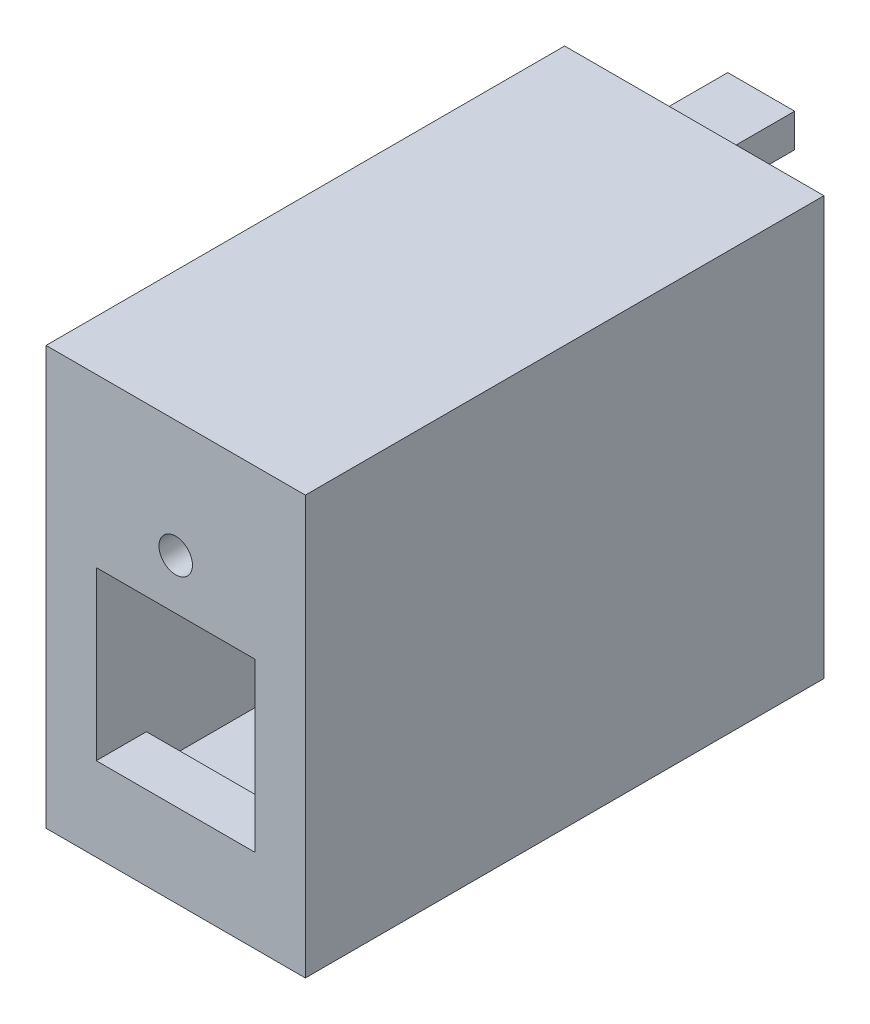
ISO-10303-21;
HEADER;
FILE_DESCRIPTION(('STEP AP214'),'2;1');
FILE_NAME('part.step','',(''),(''),'','','');
FILE_SCHEMA(('AUTOMOTIVE_DESIGN { 1 0 10303 214 1 1 1 1 }'));
ENDSEC;
DATA;
#1=APPLICATION_CONTEXT('core data for automotive mechanical design processes');
#2=APPLICATION_PROTOCOL_DEFINITION('international standard','automotive_design',2000,#1);
#3=PRODUCT_CONTEXT('',#1,'mechanical');
#4=PRODUCT('Part','Part','',(#3));
#5=PRODUCT_RELATED_PRODUCT_CATEGORY('part','',(#4));
#6=PRODUCT_DEFINITION_FORMATION('','',#4);
#7=PRODUCT_DEFINITION_CONTEXT('part definition',#1,'design');
#8=PRODUCT_DEFINITION('design','',#6,#7);
#9=PRODUCT_DEFINITION_SHAPE('','',#8);
#10=(LENGTH_UNIT() NAMED_UNIT(*) SI_UNIT(.MILLI.,.METRE.));
#11=(NAMED_UNIT(*) PLANE_ANGLE_UNIT() SI_UNIT($,.RADIAN.));
#12=(NAMED_UNIT(*) SI_UNIT($,.STERADIAN.) SOLID_ANGLE_UNIT());
#13=UNCERTAINTY_MEASURE_WITH_UNIT(LENGTH_MEASURE(1.E-05),#10,'distance_accuracy_value','');
#14=(GEOMETRIC_REPRESENTATION_CONTEXT(3) GLOBAL_UNCERTAINTY_ASSIGNED_CONTEXT((#13)) GLOBAL_UNIT_ASSIGNED_CONTEXT((#10,
#11,#12)) REPRESENTATION_CONTEXT('',''));
#15=CARTESIAN_POINT('',(0.,0.,0.));
#16=DIRECTION('',(0.,0.,1.));
#17=DIRECTION('',(1.,0.,0.));
#18=AXIS2_PLACEMENT_3D('',#15,#16,#17);
#19=CARTESIAN_POINT('',(0.,0.,0.));
#20=DIRECTION('',(0.,0.,1.));
#21=DIRECTION('',(1.,0.,0.));
#22=AXIS2_PLACEMENT_3D('',#19,#20,#21);
#23=PLANE('',#22);
#24=DIRECTION('',(1.,0.,0.));
#25=VECTOR('',#24,1.);
#26=CARTESIAN_POINT('',(96.75,-12.,0.));
#27=LINE('',#26,#25);
#28=CARTESIAN_POINT('',(92.75,-12.,0.));
#29=VERTEX_POINT('',#28);
#30=CARTESIAN_POINT('',(96.75,-12.,0.));
#31=VERTEX_POINT('',#30);
#32=EDGE_CURVE('E206',#29,#31,#27,.T.);
#33=ORIENTED_EDGE('',*,*,#32,.T.);
#34=DIRECTION('',(0.,1.,0.));
#35=VECTOR('',#34,1.);
#36=CARTESIAN_POINT('',(96.75,-12.,0.));
#37=LINE('',#36,#35);
#38=CARTESIAN_POINT('',(96.75,-10.,0.));
#39=VERTEX_POINT('',#38);
#40=EDGE_CURVE('E180',#31,#39,#37,.T.);
#41=ORIENTED_EDGE('',*,*,#40,.T.);
#42=DIRECTION('',(-1.,0.,0.));
#43=VECTOR('',#42,1.);
#44=CARTESIAN_POINT('',(96.75,-10.,0.));
#45=LINE('',#44,#43);
#46=CARTESIAN_POINT('',(92.75,-10.,0.));
#47=VERTEX_POINT('',#46);
#48=EDGE_CURVE('E196',#39,#47,#45,.T.);
#49=ORIENTED_EDGE('',*,*,#48,.T.);
#50=DIRECTION('',(0.,-1.,0.));
#51=VECTOR('',#50,1.);
#52=CARTESIAN_POINT('',(92.75,-12.,0.));
#53=LINE('',#52,#51);
#54=EDGE_CURVE('E52',#47,#29,#53,.T.);
#55=ORIENTED_EDGE('',*,*,#54,.T.);
#56=EDGE_LOOP('',(#33,#41,#49,#55));
#57=FACE_BOUND('',#56,.T.);
#58=DIRECTION('',(0.,1.,0.));
#59=VECTOR('',#58,1.);
#60=CARTESIAN_POINT('',(102.5,12.5,0.));
#61=LINE('',#60,#59);
#62=CARTESIAN_POINT('',(102.5,-12.5,0.));
#63=VERTEX_POINT('',#62);
#64=CARTESIAN_POINT('',(102.5,12.5,0.));
#65=VERTEX_POINT('',#64);
#66=EDGE_CURVE('E340',#63,#65,#61,.T.);
#67=ORIENTED_EDGE('',*,*,#66,.F.);
#68=DIRECTION('',(1.,0.,0.));
#69=VECTOR('',#68,1.);
#70=CARTESIAN_POINT('',(87.,-12.5,0.));
#71=LINE('',#70,#69);
#72=CARTESIAN_POINT('',(87.,-12.5,0.));
#73=VERTEX_POINT('',#72);
#74=EDGE_CURVE('E327',#73,#63,#71,.T.);
#75=ORIENTED_EDGE('',*,*,#74,.F.);
#76=DIRECTION('',(0.,-1.,0.));
#77=VECTOR('',#76,1.);
#78=CARTESIAN_POINT('',(87.,12.5,0.));
#79=LINE('',#78,#77);
#80=CARTESIAN_POINT('',(87.,12.5,0.));
#81=VERTEX_POINT('',#80);
#82=EDGE_CURVE('E332',#81,#73,#79,.T.);
#83=ORIENTED_EDGE('',*,*,#82,.F.);
#84=DIRECTION('',(-1.,0.,0.));
#85=VECTOR('',#84,1.);
#86=CARTESIAN_POINT('',(87.,12.5,0.));
#87=LINE('',#86,#85);
#88=EDGE_CURVE('E336',#65,#81,#87,.T.);
#89=ORIENTED_EDGE('',*,*,#88,.F.);
#90=EDGE_LOOP('',(#67,#75,#83,#89));
#91=FACE_BOUND('',#90,.T.);
#92=DIRECTION('',(1.,0.,0.));
#93=VECTOR('',#92,1.);
#94=CARTESIAN_POINT('',(87.,-9.49999999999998,0.));
#95=LINE('',#94,#93);
#96=CARTESIAN_POINT('',(90.,-9.49999999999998,0.));
#97=VERTEX_POINT('',#96);
#98=CARTESIAN_POINT('',(99.5,-9.49999999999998,0.));
#99=VERTEX_POINT('',#98);
#100=EDGE_CURVE('E311',#97,#99,#95,.T.);
#101=ORIENTED_EDGE('',*,*,#100,.T.);
#102=DIRECTION('',(0.,1.,0.));
#103=VECTOR('',#102,1.);
#104=CARTESIAN_POINT('',(99.5,12.5,0.));
#105=LINE('',#104,#103);
#106=CARTESIAN_POINT('',(99.5,9.50000000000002,0.));
#107=VERTEX_POINT('',#106);
#108=EDGE_CURVE('E316',#99,#107,#105,.T.);
#109=ORIENTED_EDGE('',*,*,#108,.T.);
#110=DIRECTION('',(-1.,0.,0.));
#111=VECTOR('',#110,1.);
#112=CARTESIAN_POINT('',(87.,9.50000000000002,0.));
#113=LINE('',#112,#111);
#114=CARTESIAN_POINT('',(90.,9.50000000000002,0.));
#115=VERTEX_POINT('',#114);
#116=EDGE_CURVE('E324',#107,#115,#113,.T.);
#117=ORIENTED_EDGE('',*,*,#116,.T.);
#118=DIRECTION('',(0.,-1.,0.));
#119=VECTOR('',#118,1.);
#120=CARTESIAN_POINT('',(90.,12.5,0.));
#121=LINE('',#120,#119);
#122=EDGE_CURVE('E312',#115,#97,#121,.T.);
#123=ORIENTED_EDGE('',*,*,#122,.T.);
#124=EDGE_LOOP('',(#101,#109,#117,#123));
#125=FACE_BOUND('',#124,.T.);
#126=DIRECTION('',(0.,-1.,0.));
#127=VECTOR('',#126,1.);
#128=CARTESIAN_POINT('',(96.75,12.,0.));
#129=LINE('',#128,#127);
#130=CARTESIAN_POINT('',(96.75,12.,0.));
#131=VERTEX_POINT('',#130);
#132=CARTESIAN_POINT('',(96.75,10.,0.));
#133=VERTEX_POINT('',#132);
#134=EDGE_CURVE('E185',#131,#133,#129,.T.);
#135=ORIENTED_EDGE('',*,*,#134,.F.);
#136=DIRECTION('',(1.,0.,0.));
#137=VECTOR('',#136,1.);
#138=CARTESIAN_POINT('',(96.75,12.,0.));
#139=LINE('',#138,#137);
#140=CARTESIAN_POINT('',(92.75,12.,0.));
#141=VERTEX_POINT('',#140);
#142=EDGE_CURVE('E219',#141,#131,#139,.T.);
#143=ORIENTED_EDGE('',*,*,#142,.F.);
#144=DIRECTION('',(0.,1.,0.));
#145=VECTOR('',#144,1.);
#146=CARTESIAN_POINT('',(92.75,12.,0.));
#147=LINE('',#146,#145);
#148=CARTESIAN_POINT('',(92.75,10.,0.));
#149=VERTEX_POINT('',#148);
#150=EDGE_CURVE('E229',#149,#141,#147,.T.);
#151=ORIENTED_EDGE('',*,*,#150,.F.);
#152=DIRECTION('',(-1.,0.,0.));
#153=VECTOR('',#152,1.);
#154=CARTESIAN_POINT('',(96.75,10.,0.));
#155=LINE('',#154,#153);
#156=EDGE_CURVE('E60',#133,#149,#155,.T.);
#157=ORIENTED_EDGE('',*,*,#156,.F.);
#158=EDGE_LOOP('',(#135,#143,#151,#157));
#159=FACE_BOUND('',#158,.T.);
#160=ADVANCED_FACE('F35',(#57,#91,#125,#159),#23,.F.);
#161=CARTESIAN_POINT('',(0.,0.,28.));
#162=DIRECTION('',(0.,0.,1.));
#163=DIRECTION('',(1.,0.,0.));
#164=AXIS2_PLACEMENT_3D('',#161,#162,#163);
#165=PLANE('',#164);
#166=DIRECTION('',(-1.,0.,0.));
#167=VECTOR('',#166,1.);
#168=CARTESIAN_POINT('',(90.,-7.49999999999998,28.));
#169=LINE('',#168,#167);
#170=CARTESIAN_POINT('',(99.5,-7.49999999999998,28.));
#171=VERTEX_POINT('',#170);
#172=CARTESIAN_POINT('',(90.,-7.49999999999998,28.));
#173=VERTEX_POINT('',#172);
#174=EDGE_CURVE('E250',#171,#173,#169,.T.);
#175=ORIENTED_EDGE('',*,*,#174,.F.);
#176=DIRECTION('',(0.,1.,0.));
#177=VECTOR('',#176,1.);
#178=CARTESIAN_POINT('',(99.5,12.5,28.));
#179=LINE('',#178,#177);
#180=CARTESIAN_POINT('',(99.5,-9.49999999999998,28.));
#181=VERTEX_POINT('',#180);
#182=EDGE_CURVE('E294',#181,#171,#179,.T.);
#183=ORIENTED_EDGE('',*,*,#182,.F.);
#184=DIRECTION('',(1.,0.,0.));
#185=VECTOR('',#184,1.);
#186=CARTESIAN_POINT('',(87.,-9.49999999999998,28.));
#187=LINE('',#186,#185);
#188=CARTESIAN_POINT('',(90.,-9.49999999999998,28.));
#189=VERTEX_POINT('',#188);
#190=EDGE_CURVE('E313',#189,#181,#187,.T.);
#191=ORIENTED_EDGE('',*,*,#190,.F.);
#192=DIRECTION('',(0.,-1.,0.));
#193=VECTOR('',#192,1.);
#194=CARTESIAN_POINT('',(90.,12.5,28.));
#195=LINE('',#194,#193);
#196=EDGE_CURVE('E298',#173,#189,#195,.T.);
#197=ORIENTED_EDGE('',*,*,#196,.F.);
#198=EDGE_LOOP('',(#175,#183,#191,#197));
#199=FACE_BOUND('',#198,.T.);
#200=ADVANCED_FACE('F383',(#199),#165,.F.);
#201=CARTESIAN_POINT('',(94.75,5.50000000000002,28.));
#202=DIRECTION('',(0.,0.,1.));
#203=DIRECTION('',(1.,0.,0.));
#204=AXIS2_PLACEMENT_3D('',#201,#202,#203);
#205=CIRCLE('',#204,0.999999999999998);
#206=CARTESIAN_POINT('',(95.75,5.50000000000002,28.));
#207=VERTEX_POINT('',#206);
#208=EDGE_CURVE('E247',#207,#207,#205,.F.);
#209=ORIENTED_EDGE('',*,*,#208,.F.);
#210=EDGE_LOOP('',(#209));
#211=FACE_BOUND('',#210,.T.);
#212=DIRECTION('',(1.,0.,0.));
#213=VECTOR('',#212,1.);
#214=CARTESIAN_POINT('',(99.5,2.50000000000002,28.));
#215=LINE('',#214,#213);
#216=CARTESIAN_POINT('',(90.,2.50000000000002,28.));
#217=VERTEX_POINT('',#216);
#218=CARTESIAN_POINT('',(99.5,2.50000000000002,28.));
#219=VERTEX_POINT('',#218);
#220=EDGE_CURVE('E263',#217,#219,#215,.T.);
#221=ORIENTED_EDGE('',*,*,#220,.F.);
#222=CARTESIAN_POINT('',(90.,9.50000000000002,28.));
#223=VERTEX_POINT('',#222);
#224=EDGE_CURVE('E301',#223,#217,#195,.T.);
#225=ORIENTED_EDGE('',*,*,#224,.F.);
#226=DIRECTION('',(-1.,0.,0.));
#227=VECTOR('',#226,1.);
#228=CARTESIAN_POINT('',(87.,9.50000000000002,28.));
#229=LINE('',#228,#227);
#230=CARTESIAN_POINT('',(99.5,9.50000000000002,28.));
#231=VERTEX_POINT('',#230);
#232=EDGE_CURVE('E297',#231,#223,#229,.T.);
#233=ORIENTED_EDGE('',*,*,#232,.F.);
#234=EDGE_CURVE('E279',#219,#231,#179,.T.);
#235=ORIENTED_EDGE('',*,*,#234,.F.);
#236=EDGE_LOOP('',(#221,#225,#233,#235));
#237=FACE_BOUND('',#236,.T.);
#238=ADVANCED_FACE('F362',(#211,#237),#165,.F.);
#239=CARTESIAN_POINT('',(102.5,12.5,63.4151321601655));
#240=DIRECTION('',(-1.,0.,0.));
#241=DIRECTION('',(0.,-1.,0.));
#242=AXIS2_PLACEMENT_3D('',#239,#240,#241);
#243=PLANE('',#242);
#244=DIRECTION('',(0.,1.,0.));
#245=VECTOR('',#244,1.);
#246=CARTESIAN_POINT('',(102.5,12.5,31.));
#247=LINE('',#246,#245);
#248=CARTESIAN_POINT('',(102.5,-12.5,31.));
#249=VERTEX_POINT('',#248);
#250=CARTESIAN_POINT('',(102.5,12.5,31.));
#251=VERTEX_POINT('',#250);
#252=EDGE_CURVE('E346',#249,#251,#247,.T.);
#253=ORIENTED_EDGE('',*,*,#252,.F.);
#254=DIRECTION('',(0.,0.,-1.));
#255=VECTOR('',#254,1.);
#256=CARTESIAN_POINT('',(102.5,-12.5,63.4151321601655));
#257=LINE('',#256,#255);
#258=EDGE_CURVE('E342',#249,#63,#257,.T.);
#259=ORIENTED_EDGE('',*,*,#258,.T.);
#260=ORIENTED_EDGE('',*,*,#66,.T.);
#261=DIRECTION('',(0.,0.,-1.));
#262=VECTOR('',#261,1.);
#263=CARTESIAN_POINT('',(102.5,12.5,63.4151321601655));
#264=LINE('',#263,#262);
#265=EDGE_CURVE('E339',#251,#65,#264,.T.);
#266=ORIENTED_EDGE('',*,*,#265,.F.);
#267=EDGE_LOOP('',(#253,#259,#260,#266));
#268=FACE_BOUND('',#267,.T.);
#269=ADVANCED_FACE('F451',(#268),#243,.F.);
#270=CARTESIAN_POINT('',(87.,12.5,63.4151321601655));
#271=DIRECTION('',(0.,-1.,0.));
#272=DIRECTION('',(0.,0.,-1.));
#273=AXIS2_PLACEMENT_3D('',#270,#271,#272);
#274=PLANE('',#273);
#275=DIRECTION('',(-1.,0.,0.));
#276=VECTOR('',#275,1.);
#277=CARTESIAN_POINT('',(87.,12.5,31.));
#278=LINE('',#277,#276);
#279=CARTESIAN_POINT('',(87.,12.5,31.));
#280=VERTEX_POINT('',#279);
#281=EDGE_CURVE('E44',#251,#280,#278,.T.);
#282=ORIENTED_EDGE('',*,*,#281,.F.);
#283=ORIENTED_EDGE('',*,*,#265,.T.);
#284=ORIENTED_EDGE('',*,*,#88,.T.);
#285=DIRECTION('',(0.,0.,-1.));
#286=VECTOR('',#285,1.);
#287=CARTESIAN_POINT('',(87.,12.5,63.4151321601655));
#288=LINE('',#287,#286);
#289=EDGE_CURVE('E335',#280,#81,#288,.T.);
#290=ORIENTED_EDGE('',*,*,#289,.F.);
#291=EDGE_LOOP('',(#282,#283,#284,#290));
#292=FACE_BOUND('',#291,.T.);
#293=ADVANCED_FACE('F448',(#292),#274,.F.);
#294=CARTESIAN_POINT('',(87.,12.5,63.4151321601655));
#295=DIRECTION('',(1.,0.,0.));
#296=DIRECTION('',(0.,0.,-1.));
#297=AXIS2_PLACEMENT_3D('',#294,#295,#296);
#298=PLANE('',#297);
#299=DIRECTION('',(0.,-1.,0.));
#300=VECTOR('',#299,1.);
#301=CARTESIAN_POINT('',(87.,12.5,31.));
#302=LINE('',#301,#300);
#303=CARTESIAN_POINT('',(87.,-12.5,31.));
#304=VERTEX_POINT('',#303);
#305=EDGE_CURVE('E12',#280,#304,#302,.T.);
#306=ORIENTED_EDGE('',*,*,#305,.F.);
#307=ORIENTED_EDGE('',*,*,#289,.T.);
#308=ORIENTED_EDGE('',*,*,#82,.T.);
#309=DIRECTION('',(0.,0.,-1.));
#310=VECTOR('',#309,1.);
#311=CARTESIAN_POINT('',(87.,-12.5,63.4151321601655));
#312=LINE('',#311,#310);
#313=EDGE_CURVE('E331',#304,#73,#312,.T.);
#314=ORIENTED_EDGE('',*,*,#313,.F.);
#315=EDGE_LOOP('',(#306,#307,#308,#314));
#316=FACE_BOUND('',#315,.T.);
#317=ADVANCED_FACE('F444',(#316),#298,.F.);
#318=CARTESIAN_POINT('',(87.,-12.5,63.4151321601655));
#319=DIRECTION('',(0.,1.,0.));
#320=DIRECTION('',(0.,0.,1.));
#321=AXIS2_PLACEMENT_3D('',#318,#319,#320);
#322=PLANE('',#321);
#323=DIRECTION('',(1.,0.,0.));
#324=VECTOR('',#323,1.);
#325=CARTESIAN_POINT('',(87.,-12.5,31.));
#326=LINE('',#325,#324);
#327=EDGE_CURVE('E330',#304,#249,#326,.T.);
#328=ORIENTED_EDGE('',*,*,#327,.F.);
#329=ORIENTED_EDGE('',*,*,#313,.T.);
#330=ORIENTED_EDGE('',*,*,#74,.T.);
#331=ORIENTED_EDGE('',*,*,#258,.F.);
#332=EDGE_LOOP('',(#328,#329,#330,#331));
#333=FACE_BOUND('',#332,.T.);
#334=ADVANCED_FACE('F441',(#333),#322,.F.);
#335=CARTESIAN_POINT('',(0.,0.,31.));
#336=DIRECTION('',(0.,0.,1.));
#337=DIRECTION('',(1.,0.,0.));
#338=AXIS2_PLACEMENT_3D('',#335,#336,#337);
#339=PLANE('',#338);
#340=CARTESIAN_POINT('',(94.75,5.50000000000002,31.));
#341=DIRECTION('',(0.,0.,1.));
#342=DIRECTION('',(1.,0.,0.));
#343=AXIS2_PLACEMENT_3D('',#340,#341,#342);
#344=CIRCLE('',#343,0.999999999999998);
#345=CARTESIAN_POINT('',(95.75,5.50000000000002,31.));
#346=VERTEX_POINT('',#345);
#347=EDGE_CURVE('E244',#346,#346,#344,.T.);
#348=ORIENTED_EDGE('',*,*,#347,.F.);
#349=EDGE_LOOP('',(#348));
#350=FACE_BOUND('',#349,.T.);
#351=DIRECTION('',(0.,1.,0.));
#352=VECTOR('',#351,1.);
#353=CARTESIAN_POINT('',(99.5,-7.49999999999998,31.));
#354=LINE('',#353,#352);
#355=CARTESIAN_POINT('',(99.5,-7.49999999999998,31.));
#356=VERTEX_POINT('',#355);
#357=CARTESIAN_POINT('',(99.5,2.50000000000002,31.));
#358=VERTEX_POINT('',#357);
#359=EDGE_CURVE('E253',#356,#358,#354,.T.);
#360=ORIENTED_EDGE('',*,*,#359,.F.);
#361=DIRECTION('',(1.,0.,0.));
#362=VECTOR('',#361,1.);
#363=CARTESIAN_POINT('',(90.,-7.49999999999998,31.));
#364=LINE('',#363,#362);
#365=CARTESIAN_POINT('',(90.,-7.49999999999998,31.));
#366=VERTEX_POINT('',#365);
#367=EDGE_CURVE('E276',#366,#356,#364,.T.);
#368=ORIENTED_EDGE('',*,*,#367,.F.);
#369=DIRECTION('',(0.,-1.,0.));
#370=VECTOR('',#369,1.);
#371=CARTESIAN_POINT('',(90.,2.50000000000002,31.));
#372=LINE('',#371,#370);
#373=CARTESIAN_POINT('',(90.,2.50000000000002,31.));
#374=VERTEX_POINT('',#373);
#375=EDGE_CURVE('E372',#374,#366,#372,.T.);
#376=ORIENTED_EDGE('',*,*,#375,.F.);
#377=DIRECTION('',(-1.,0.,0.));
#378=VECTOR('',#377,1.);
#379=CARTESIAN_POINT('',(99.5,2.50000000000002,31.));
#380=LINE('',#379,#378);
#381=EDGE_CURVE('E368',#358,#374,#380,.T.);
#382=ORIENTED_EDGE('',*,*,#381,.F.);
#383=EDGE_LOOP('',(#360,#368,#376,#382));
#384=FACE_BOUND('',#383,.T.);
#385=ORIENTED_EDGE('',*,*,#327,.T.);
#386=ORIENTED_EDGE('',*,*,#252,.T.);
#387=ORIENTED_EDGE('',*,*,#281,.T.);
#388=ORIENTED_EDGE('',*,*,#305,.T.);
#389=EDGE_LOOP('',(#385,#386,#387,#388));
#390=FACE_BOUND('',#389,.T.);
#391=ADVANCED_FACE('F37',(#350,#384,#390),#339,.T.);
#392=CARTESIAN_POINT('',(99.5,12.5,63.4151321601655));
#393=DIRECTION('',(-1.,0.,0.));
#394=DIRECTION('',(0.,-1.,0.));
#395=AXIS2_PLACEMENT_3D('',#392,#393,#394);
#396=PLANE('',#395);
#397=ORIENTED_EDGE('',*,*,#182,.T.);
#398=DIRECTION('',(0.,0.,1.));
#399=VECTOR('',#398,1.);
#400=CARTESIAN_POINT('',(99.5,-7.49999999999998,-0.001000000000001));
#401=LINE('',#400,#399);
#402=EDGE_CURVE('E261',#171,#356,#401,.T.);
#403=ORIENTED_EDGE('',*,*,#402,.T.);
#404=ORIENTED_EDGE('',*,*,#359,.T.);
#405=DIRECTION('',(0.,0.,1.));
#406=VECTOR('',#405,1.);
#407=CARTESIAN_POINT('',(99.5,2.50000000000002,-0.001000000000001));
#408=LINE('',#407,#406);
#409=EDGE_CURVE('E270',#219,#358,#408,.T.);
#410=ORIENTED_EDGE('',*,*,#409,.F.);
#411=ORIENTED_EDGE('',*,*,#234,.T.);
#412=DIRECTION('',(0.,0.,-1.));
#413=VECTOR('',#412,1.);
#414=CARTESIAN_POINT('',(99.5,9.50000000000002,63.4151321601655));
#415=LINE('',#414,#413);
#416=EDGE_CURVE('E319',#231,#107,#415,.T.);
#417=ORIENTED_EDGE('',*,*,#416,.T.);
#418=ORIENTED_EDGE('',*,*,#108,.F.);
#419=DIRECTION('',(0.,0.,-1.));
#420=VECTOR('',#419,1.);
#421=CARTESIAN_POINT('',(99.5,-9.49999999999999,63.4151321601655));
#422=LINE('',#421,#420);
#423=EDGE_CURVE('E286',#181,#99,#422,.T.);
#424=ORIENTED_EDGE('',*,*,#423,.F.);
#425=EDGE_LOOP('',(#397,#403,#404,#410,#411,#417,#418,#424));
#426=FACE_BOUND('',#425,.T.);
#427=ADVANCED_FACE('F378',(#426),#396,.T.);
#428=CARTESIAN_POINT('',(87.,9.50000000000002,63.4151321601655));
#429=DIRECTION('',(0.,-1.,0.));
#430=DIRECTION('',(0.,0.,-1.));
#431=AXIS2_PLACEMENT_3D('',#428,#429,#430);
#432=PLANE('',#431);
#433=ORIENTED_EDGE('',*,*,#232,.T.);
#434=DIRECTION('',(0.,0.,-1.));
#435=VECTOR('',#434,1.);
#436=CARTESIAN_POINT('',(90.,9.50000000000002,63.4151321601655));
#437=LINE('',#436,#435);
#438=EDGE_CURVE('E306',#223,#115,#437,.T.);
#439=ORIENTED_EDGE('',*,*,#438,.T.);
#440=ORIENTED_EDGE('',*,*,#116,.F.);
#441=ORIENTED_EDGE('',*,*,#416,.F.);
#442=EDGE_LOOP('',(#433,#439,#440,#441));
#443=FACE_BOUND('',#442,.T.);
#444=ADVANCED_FACE('F392',(#443),#432,.T.);
#445=CARTESIAN_POINT('',(90.,12.5,63.4151321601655));
#446=DIRECTION('',(1.,0.,0.));
#447=DIRECTION('',(0.,0.,-1.));
#448=AXIS2_PLACEMENT_3D('',#445,#446,#447);
#449=PLANE('',#448);
#450=ORIENTED_EDGE('',*,*,#224,.T.);
#451=DIRECTION('',(0.,0.,1.));
#452=VECTOR('',#451,1.);
#453=CARTESIAN_POINT('',(90.,2.50000000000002,-0.001000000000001));
#454=LINE('',#453,#452);
#455=EDGE_CURVE('E266',#217,#374,#454,.T.);
#456=ORIENTED_EDGE('',*,*,#455,.T.);
#457=ORIENTED_EDGE('',*,*,#375,.T.);
#458=DIRECTION('',(0.,0.,1.));
#459=VECTOR('',#458,1.);
#460=CARTESIAN_POINT('',(90.,-7.49999999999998,-0.001000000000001));
#461=LINE('',#460,#459);
#462=EDGE_CURVE('E264',#173,#366,#461,.T.);
#463=ORIENTED_EDGE('',*,*,#462,.F.);
#464=ORIENTED_EDGE('',*,*,#196,.T.);
#465=DIRECTION('',(0.,0.,-1.));
#466=VECTOR('',#465,1.);
#467=CARTESIAN_POINT('',(90.,-9.49999999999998,63.4151321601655));
#468=LINE('',#467,#466);
#469=EDGE_CURVE('E308',#189,#97,#468,.T.);
#470=ORIENTED_EDGE('',*,*,#469,.T.);
#471=ORIENTED_EDGE('',*,*,#122,.F.);
#472=ORIENTED_EDGE('',*,*,#438,.F.);
#473=EDGE_LOOP('',(#450,#456,#457,#463,#464,#470,#471,#472));
#474=FACE_BOUND('',#473,.T.);
#475=ADVANCED_FACE('F356',(#474),#449,.T.);
#476=CARTESIAN_POINT('',(87.,-9.49999999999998,63.4151321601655));
#477=DIRECTION('',(0.,1.,0.));
#478=DIRECTION('',(0.,0.,1.));
#479=AXIS2_PLACEMENT_3D('',#476,#477,#478);
#480=PLANE('',#479);
#481=ORIENTED_EDGE('',*,*,#190,.T.);
#482=ORIENTED_EDGE('',*,*,#423,.T.);
#483=ORIENTED_EDGE('',*,*,#100,.F.);
#484=ORIENTED_EDGE('',*,*,#469,.F.);
#485=EDGE_LOOP('',(#481,#482,#483,#484));
#486=FACE_BOUND('',#485,.T.);
#487=ADVANCED_FACE('F387',(#486),#480,.T.);
#488=CARTESIAN_POINT('',(90.,-7.49999999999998,-0.001000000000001));
#489=DIRECTION('',(0.,-1.,0.));
#490=DIRECTION('',(0.,0.,-1.));
#491=AXIS2_PLACEMENT_3D('',#488,#489,#490);
#492=PLANE('',#491);
#493=ORIENTED_EDGE('',*,*,#174,.T.);
#494=ORIENTED_EDGE('',*,*,#462,.T.);
#495=ORIENTED_EDGE('',*,*,#367,.T.);
#496=ORIENTED_EDGE('',*,*,#402,.F.);
#497=EDGE_LOOP('',(#493,#494,#495,#496));
#498=FACE_BOUND('',#497,.T.);
#499=ADVANCED_FACE('F375',(#498),#492,.F.);
#500=CARTESIAN_POINT('',(99.5,2.50000000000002,-0.001000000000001));
#501=DIRECTION('',(0.,1.,0.));
#502=DIRECTION('',(-1.,0.,0.));
#503=AXIS2_PLACEMENT_3D('',#500,#501,#502);
#504=PLANE('',#503);
#505=ORIENTED_EDGE('',*,*,#220,.T.);
#506=ORIENTED_EDGE('',*,*,#409,.T.);
#507=ORIENTED_EDGE('',*,*,#381,.T.);
#508=ORIENTED_EDGE('',*,*,#455,.F.);
#509=EDGE_LOOP('',(#505,#506,#507,#508));
#510=FACE_BOUND('',#509,.T.);
#511=ADVANCED_FACE('F366',(#510),#504,.F.);
#512=CARTESIAN_POINT('',(94.75,5.50000000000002,-0.001000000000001));
#513=DIRECTION('',(0.,0.,1.));
#514=DIRECTION('',(1.,0.,0.));
#515=AXIS2_PLACEMENT_3D('',#512,#513,#514);
#516=CYLINDRICAL_SURFACE('',#515,0.999999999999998);
#517=ORIENTED_EDGE('',*,*,#347,.T.);
#518=EDGE_LOOP('',(#517));
#519=FACE_BOUND('',#518,.T.);
#520=ORIENTED_EDGE('',*,*,#208,.T.);
#521=EDGE_LOOP('',(#520));
#522=FACE_BOUND('',#521,.T.);
#523=ADVANCED_FACE('F420',(#519,#522),#516,.F.);
#524=CARTESIAN_POINT('',(96.75,12.,-4.));
#525=DIRECTION('',(-1.,0.,0.));
#526=DIRECTION('',(0.,0.,1.));
#527=AXIS2_PLACEMENT_3D('',#524,#525,#526);
#528=PLANE('',#527);
#529=ORIENTED_EDGE('',*,*,#134,.T.);
#530=DIRECTION('',(0.,0.,1.));
#531=VECTOR('',#530,1.);
#532=CARTESIAN_POINT('',(96.75,10.,-4.));
#533=LINE('',#532,#531);
#534=CARTESIAN_POINT('',(96.75,10.,-4.));
#535=VERTEX_POINT('',#534);
#536=EDGE_CURVE('E242',#535,#133,#533,.T.);
#537=ORIENTED_EDGE('',*,*,#536,.F.);
#538=DIRECTION('',(0.,-1.,0.));
#539=VECTOR('',#538,1.);
#540=CARTESIAN_POINT('',(96.75,12.,-4.));
#541=LINE('',#540,#539);
#542=CARTESIAN_POINT('',(96.75,12.,-4.));
#543=VERTEX_POINT('',#542);
#544=EDGE_CURVE('E215',#543,#535,#541,.T.);
#545=ORIENTED_EDGE('',*,*,#544,.F.);
#546=DIRECTION('',(0.,0.,1.));
#547=VECTOR('',#546,1.);
#548=CARTESIAN_POINT('',(96.75,12.,-4.));
#549=LINE('',#548,#547);
#550=EDGE_CURVE('E225',#543,#131,#549,.T.);
#551=ORIENTED_EDGE('',*,*,#550,.T.);
#552=EDGE_LOOP('',(#529,#537,#545,#551));
#553=FACE_BOUND('',#552,.T.);
#554=ADVANCED_FACE('F404',(#553),#528,.F.);
#555=CARTESIAN_POINT('',(96.75,10.,-4.));
#556=DIRECTION('',(0.,1.,0.));
#557=DIRECTION('',(0.,0.,1.));
#558=AXIS2_PLACEMENT_3D('',#555,#556,#557);
#559=PLANE('',#558);
#560=ORIENTED_EDGE('',*,*,#156,.T.);
#561=DIRECTION('',(0.,0.,1.));
#562=VECTOR('',#561,1.);
#563=CARTESIAN_POINT('',(92.75,10.,-4.));
#564=LINE('',#563,#562);
#565=CARTESIAN_POINT('',(92.75,10.,-4.));
#566=VERTEX_POINT('',#565);
#567=EDGE_CURVE('E239',#566,#149,#564,.T.);
#568=ORIENTED_EDGE('',*,*,#567,.F.);
#569=DIRECTION('',(-1.,0.,0.));
#570=VECTOR('',#569,1.);
#571=CARTESIAN_POINT('',(96.75,10.,-4.));
#572=LINE('',#571,#570);
#573=EDGE_CURVE('E218',#535,#566,#572,.T.);
#574=ORIENTED_EDGE('',*,*,#573,.F.);
#575=ORIENTED_EDGE('',*,*,#536,.T.);
#576=EDGE_LOOP('',(#560,#568,#574,#575));
#577=FACE_BOUND('',#576,.T.);
#578=ADVANCED_FACE('F412',(#577),#559,.F.);
#579=CARTESIAN_POINT('',(92.75,12.,-4.));
#580=DIRECTION('',(1.,0.,0.));
#581=DIRECTION('',(0.,0.,-1.));
#582=AXIS2_PLACEMENT_3D('',#579,#580,#581);
#583=PLANE('',#582);
#584=ORIENTED_EDGE('',*,*,#150,.T.);
#585=DIRECTION('',(0.,0.,1.));
#586=VECTOR('',#585,1.);
#587=CARTESIAN_POINT('',(92.75,12.,-4.));
#588=LINE('',#587,#586);
#589=CARTESIAN_POINT('',(92.75,12.,-4.));
#590=VERTEX_POINT('',#589);
#591=EDGE_CURVE('E236',#590,#141,#588,.T.);
#592=ORIENTED_EDGE('',*,*,#591,.F.);
#593=DIRECTION('',(0.,1.,0.));
#594=VECTOR('',#593,1.);
#595=CARTESIAN_POINT('',(92.75,12.,-4.));
#596=LINE('',#595,#594);
#597=EDGE_CURVE('E221',#566,#590,#596,.T.);
#598=ORIENTED_EDGE('',*,*,#597,.F.);
#599=ORIENTED_EDGE('',*,*,#567,.T.);
#600=EDGE_LOOP('',(#584,#592,#598,#599));
#601=FACE_BOUND('',#600,.T.);
#602=ADVANCED_FACE('F410',(#601),#583,.F.);
#603=CARTESIAN_POINT('',(96.75,12.,-4.));
#604=DIRECTION('',(0.,-1.,0.));
#605=DIRECTION('',(0.,0.,-1.));
#606=AXIS2_PLACEMENT_3D('',#603,#604,#605);
#607=PLANE('',#606);
#608=ORIENTED_EDGE('',*,*,#142,.T.);
#609=ORIENTED_EDGE('',*,*,#550,.F.);
#610=DIRECTION('',(1.,0.,0.));
#611=VECTOR('',#610,1.);
#612=CARTESIAN_POINT('',(96.75,12.,-4.));
#613=LINE('',#612,#611);
#614=EDGE_CURVE('E223',#590,#543,#613,.T.);
#615=ORIENTED_EDGE('',*,*,#614,.F.);
#616=ORIENTED_EDGE('',*,*,#591,.T.);
#617=EDGE_LOOP('',(#608,#609,#615,#616));
#618=FACE_BOUND('',#617,.T.);
#619=ADVANCED_FACE('F400',(#618),#607,.F.);
#620=CARTESIAN_POINT('',(0.,0.,-4.));
#621=DIRECTION('',(0.,0.,-1.));
#622=DIRECTION('',(-1.,0.,0.));
#623=AXIS2_PLACEMENT_3D('',#620,#621,#622);
#624=PLANE('',#623);
#625=ORIENTED_EDGE('',*,*,#544,.T.);
#626=ORIENTED_EDGE('',*,*,#573,.T.);
#627=ORIENTED_EDGE('',*,*,#597,.T.);
#628=ORIENTED_EDGE('',*,*,#614,.T.);
#629=EDGE_LOOP('',(#625,#626,#627,#628));
#630=FACE_BOUND('',#629,.T.);
#631=ADVANCED_FACE('F406',(#630),#624,.T.);
#632=CARTESIAN_POINT('',(96.75,-12.,-4.));
#633=DIRECTION('',(1.,0.,0.));
#634=DIRECTION('',(0.,0.,-1.));
#635=AXIS2_PLACEMENT_3D('',#632,#633,#634);
#636=PLANE('',#635);
#637=ORIENTED_EDGE('',*,*,#40,.F.);
#638=DIRECTION('',(0.,0.,1.));
#639=VECTOR('',#638,1.);
#640=CARTESIAN_POINT('',(96.75,-12.,-4.));
#641=LINE('',#640,#639);
#642=CARTESIAN_POINT('',(96.75,-12.,-4.));
#643=VERTEX_POINT('',#642);
#644=EDGE_CURVE('E174',#643,#31,#641,.T.);
#645=ORIENTED_EDGE('',*,*,#644,.F.);
#646=DIRECTION('',(0.,1.,0.));
#647=VECTOR('',#646,1.);
#648=CARTESIAN_POINT('',(96.75,-12.,-4.));
#649=LINE('',#648,#647);
#650=CARTESIAN_POINT('',(96.75,-10.,-4.));
#651=VERTEX_POINT('',#650);
#652=EDGE_CURVE('E177',#643,#651,#649,.T.);
#653=ORIENTED_EDGE('',*,*,#652,.T.);
#654=DIRECTION('',(0.,0.,1.));
#655=VECTOR('',#654,1.);
#656=CARTESIAN_POINT('',(96.75,-10.,-4.));
#657=LINE('',#656,#655);
#658=EDGE_CURVE('E204',#651,#39,#657,.T.);
#659=ORIENTED_EDGE('',*,*,#658,.T.);
#660=EDGE_LOOP('',(#637,#645,#653,#659));
#661=FACE_BOUND('',#660,.T.);
#662=ADVANCED_FACE('F176',(#661),#636,.T.);
#663=CARTESIAN_POINT('',(96.75,-12.,-4.));
#664=DIRECTION('',(0.,-1.,0.));
#665=DIRECTION('',(0.,0.,-1.));
#666=AXIS2_PLACEMENT_3D('',#663,#664,#665);
#667=PLANE('',#666);
#668=ORIENTED_EDGE('',*,*,#32,.F.);
#669=DIRECTION('',(0.,0.,1.));
#670=VECTOR('',#669,1.);
#671=CARTESIAN_POINT('',(92.75,-12.,-4.));
#672=LINE('',#671,#670);
#673=CARTESIAN_POINT('',(92.75,-12.,-4.));
#674=VERTEX_POINT('',#673);
#675=EDGE_CURVE('E186',#674,#29,#672,.T.);
#676=ORIENTED_EDGE('',*,*,#675,.F.);
#677=DIRECTION('',(1.,0.,0.));
#678=VECTOR('',#677,1.);
#679=CARTESIAN_POINT('',(96.75,-12.,-4.));
#680=LINE('',#679,#678);
#681=EDGE_CURVE('E192',#674,#643,#680,.T.);
#682=ORIENTED_EDGE('',*,*,#681,.T.);
#683=ORIENTED_EDGE('',*,*,#644,.T.);
#684=EDGE_LOOP('',(#668,#676,#682,#683));
#685=FACE_BOUND('',#684,.T.);
#686=ADVANCED_FACE('F198',(#685),#667,.T.);
#687=CARTESIAN_POINT('',(92.75,-12.,-4.));
#688=DIRECTION('',(-1.,0.,0.));
#689=DIRECTION('',(0.,0.,1.));
#690=AXIS2_PLACEMENT_3D('',#687,#688,#689);
#691=PLANE('',#690);
#692=ORIENTED_EDGE('',*,*,#54,.F.);
#693=DIRECTION('',(0.,0.,1.));
#694=VECTOR('',#693,1.);
#695=CARTESIAN_POINT('',(92.75,-10.,-4.));
#696=LINE('',#695,#694);
#697=CARTESIAN_POINT('',(92.75,-10.,-4.));
#698=VERTEX_POINT('',#697);
#699=EDGE_CURVE('E212',#698,#47,#696,.T.);
#700=ORIENTED_EDGE('',*,*,#699,.F.);
#701=DIRECTION('',(0.,-1.,0.));
#702=VECTOR('',#701,1.);
#703=CARTESIAN_POINT('',(92.75,-12.,-4.));
#704=LINE('',#703,#702);
#705=EDGE_CURVE('E199',#698,#674,#704,.T.);
#706=ORIENTED_EDGE('',*,*,#705,.T.);
#707=ORIENTED_EDGE('',*,*,#675,.T.);
#708=EDGE_LOOP('',(#692,#700,#706,#707));
#709=FACE_BOUND('',#708,.T.);
#710=ADVANCED_FACE('F557',(#709),#691,.T.);
#711=CARTESIAN_POINT('',(96.75,-10.,-4.));
#712=DIRECTION('',(0.,1.,0.));
#713=DIRECTION('',(0.,0.,1.));
#714=AXIS2_PLACEMENT_3D('',#711,#712,#713);
#715=PLANE('',#714);
#716=ORIENTED_EDGE('',*,*,#48,.F.);
#717=ORIENTED_EDGE('',*,*,#658,.F.);
#718=DIRECTION('',(-1.,0.,0.));
#719=VECTOR('',#718,1.);
#720=CARTESIAN_POINT('',(96.75,-10.,-4.));
#721=LINE('',#720,#719);
#722=EDGE_CURVE('E195',#651,#698,#721,.T.);
#723=ORIENTED_EDGE('',*,*,#722,.T.);
#724=ORIENTED_EDGE('',*,*,#699,.T.);
#725=EDGE_LOOP('',(#716,#717,#723,#724));
#726=FACE_BOUND('',#725,.T.);
#727=ADVANCED_FACE('F566',(#726),#715,.T.);
#728=CARTESIAN_POINT('',(0.,0.,-4.));
#729=DIRECTION('',(0.,0.,-1.));
#730=DIRECTION('',(-1.,0.,0.));
#731=AXIS2_PLACEMENT_3D('',#728,#729,#730);
#732=PLANE('',#731);
#733=ORIENTED_EDGE('',*,*,#652,.F.);
#734=ORIENTED_EDGE('',*,*,#681,.F.);
#735=ORIENTED_EDGE('',*,*,#705,.F.);
#736=ORIENTED_EDGE('',*,*,#722,.F.);
#737=EDGE_LOOP('',(#733,#734,#735,#736));
#738=FACE_BOUND('',#737,.T.);
#739=ADVANCED_FACE('F190',(#738),#732,.T.);
#740=CLOSED_SHELL('',(#160,#200,#238,#269,#293,#317,#334,#391,#427,#444,#475,#487,#499,#511,
#523,#554,#578,#602,#619,#631,#662,#686,#710,#727,#739));
#741=MANIFOLD_SOLID_BREP('B2',#740);
#742=ADVANCED_BREP_SHAPE_REPRESENTATION('',(#18,#741),#14);
#743=SHAPE_DEFINITION_REPRESENTATION(#9,#742);
ENDSEC;
END-ISO-10303-21;
